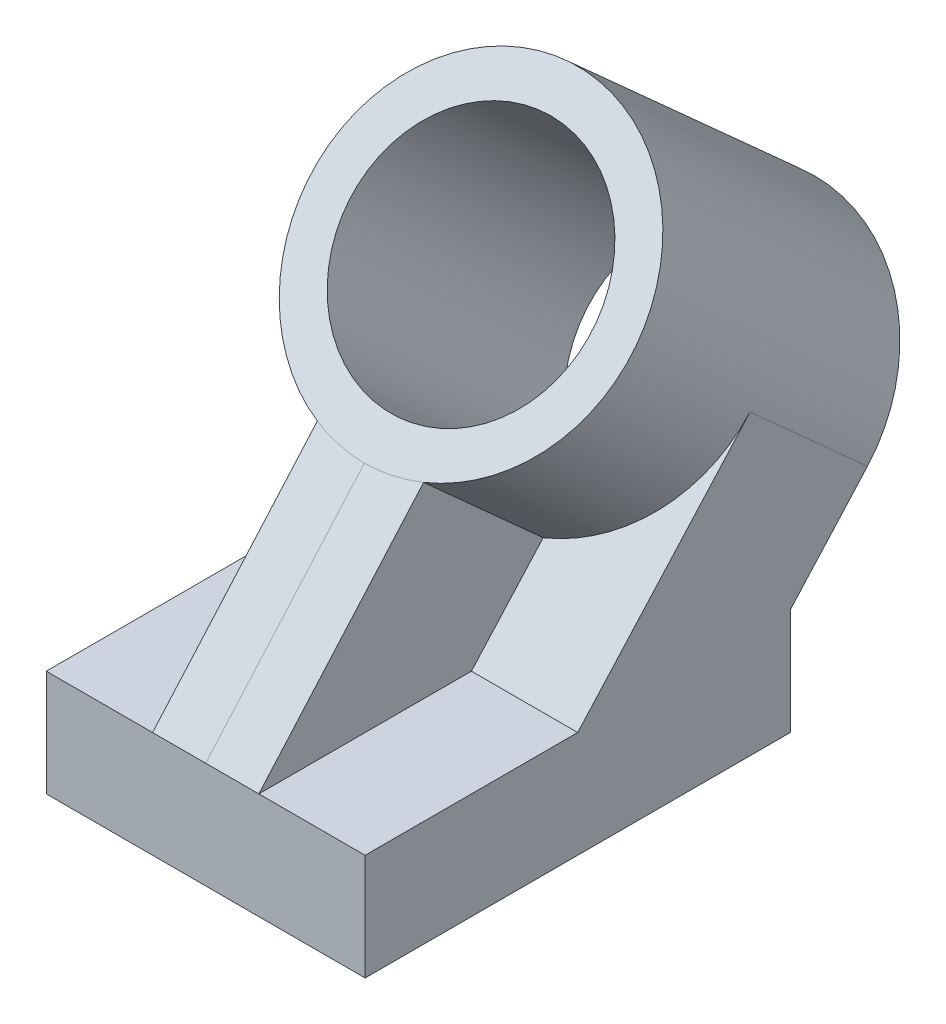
ISO-10303-21;
HEADER;
FILE_DESCRIPTION(('STEP AP214'),'2;1');
FILE_NAME('part.step','',(''),(''),'','','');
FILE_SCHEMA(('AUTOMOTIVE_DESIGN { 1 0 10303 214 1 1 1 1 }'));
ENDSEC;
DATA;
#1=APPLICATION_CONTEXT('core data for automotive mechanical design processes');
#2=APPLICATION_PROTOCOL_DEFINITION('international standard','automotive_design',2000,#1);
#3=PRODUCT_CONTEXT('',#1,'mechanical');
#4=PRODUCT('Part','Part','',(#3));
#5=PRODUCT_RELATED_PRODUCT_CATEGORY('part','',(#4));
#6=PRODUCT_DEFINITION_FORMATION('','',#4);
#7=PRODUCT_DEFINITION_CONTEXT('part definition',#1,'design');
#8=PRODUCT_DEFINITION('design','',#6,#7);
#9=PRODUCT_DEFINITION_SHAPE('','',#8);
#10=(LENGTH_UNIT() NAMED_UNIT(*) SI_UNIT(.MILLI.,.METRE.));
#11=(NAMED_UNIT(*) PLANE_ANGLE_UNIT() SI_UNIT($,.RADIAN.));
#12=(NAMED_UNIT(*) SI_UNIT($,.STERADIAN.) SOLID_ANGLE_UNIT());
#13=UNCERTAINTY_MEASURE_WITH_UNIT(LENGTH_MEASURE(1.E-05),#10,'distance_accuracy_value','');
#14=(GEOMETRIC_REPRESENTATION_CONTEXT(3) GLOBAL_UNCERTAINTY_ASSIGNED_CONTEXT((#13)) GLOBAL_UNIT_ASSIGNED_CONTEXT((#10,
#11,#12)) REPRESENTATION_CONTEXT('',''));
#15=CARTESIAN_POINT('',(0.,0.,0.));
#16=DIRECTION('',(0.,0.,1.));
#17=DIRECTION('',(1.,0.,0.));
#18=AXIS2_PLACEMENT_3D('',#15,#16,#17);
#19=CARTESIAN_POINT('',(-76.2,0.,0.));
#20=DIRECTION('',(0.,1.,0.));
#21=DIRECTION('',(0.,0.,1.));
#22=AXIS2_PLACEMENT_3D('',#19,#20,#21);
#23=PLANE('',#22);
#24=DIRECTION('',(1.,0.,0.));
#25=VECTOR('',#24,1.);
#26=CARTESIAN_POINT('',(-76.2,0.,0.));
#27=LINE('',#26,#25);
#28=CARTESIAN_POINT('',(-76.2,0.,0.));
#29=VERTEX_POINT('',#28);
#30=CARTESIAN_POINT('',(-50.8,0.,0.));
#31=VERTEX_POINT('',#30);
#32=EDGE_CURVE('E14',#29,#31,#27,.T.);
#33=ORIENTED_EDGE('',*,*,#32,.T.);
#34=DIRECTION('',(0.,0.,-1.));
#35=VECTOR('',#34,1.);
#36=CARTESIAN_POINT('',(-50.8,0.,-50.8));
#37=LINE('',#36,#35);
#38=CARTESIAN_POINT('',(-50.8,0.,-50.8));
#39=VERTEX_POINT('',#38);
#40=EDGE_CURVE('E380',#31,#39,#37,.T.);
#41=ORIENTED_EDGE('',*,*,#40,.T.);
#42=DIRECTION('',(1.,0.,0.));
#43=VECTOR('',#42,1.);
#44=CARTESIAN_POINT('',(-76.2,0.,-50.8));
#45=LINE('',#44,#43);
#46=CARTESIAN_POINT('',(-76.2,0.,-50.8));
#47=VERTEX_POINT('',#46);
#48=EDGE_CURVE('E566',#47,#39,#45,.T.);
#49=ORIENTED_EDGE('',*,*,#48,.F.);
#50=DIRECTION('',(0.,0.,1.));
#51=VECTOR('',#50,1.);
#52=CARTESIAN_POINT('',(-76.2,0.,0.));
#53=LINE('',#52,#51);
#54=EDGE_CURVE('E420',#47,#29,#53,.T.);
#55=ORIENTED_EDGE('',*,*,#54,.T.);
#56=EDGE_LOOP('',(#33,#41,#49,#55));
#57=FACE_BOUND('',#56,.T.);
#58=ADVANCED_FACE('F96',(#57),#23,.T.);
#59=CARTESIAN_POINT('',(-76.2,0.,-50.8));
#60=DIRECTION('',(0.,0.669130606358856,0.743144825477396));
#61=DIRECTION('',(0.,-0.743144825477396,0.669130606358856));
#62=AXIS2_PLACEMENT_3D('',#59,#60,#61);
#63=PLANE('',#62);
#64=DIRECTION('',(0.,0.743144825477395,-0.669130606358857));
#65=VECTOR('',#64,1.);
#66=CARTESIAN_POINT('',(-50.8,19.0490347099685,-67.9518278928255));
#67=LINE('',#66,#65);
#68=CARTESIAN_POINT('',(-50.8,19.0490347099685,-67.9518278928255));
#69=VERTEX_POINT('',#68);
#70=EDGE_CURVE('E385',#39,#69,#67,.T.);
#71=ORIENTED_EDGE('',*,*,#70,.T.);
#72=CARTESIAN_POINT('',(-38.1,45.7435581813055,-91.9876847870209));
#73=DIRECTION('',(0.,0.669130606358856,0.743144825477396));
#74=DIRECTION('',(0.,-0.743144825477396,0.669130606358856));
#75=AXIS2_PLACEMENT_3D('',#72,#73,#74);
#76=CIRCLE('',#75,38.1);
#77=CARTESIAN_POINT('',(-76.2,45.7435581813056,-91.9876847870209));
#78=VERTEX_POINT('',#77);
#79=EDGE_CURVE('E552',#78,#69,#76,.T.);
#80=ORIENTED_EDGE('',*,*,#79,.F.);
#81=DIRECTION('',(0.,-0.743144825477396,0.669130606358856));
#82=VECTOR('',#81,1.);
#83=CARTESIAN_POINT('',(-76.2,0.,-50.8));
#84=LINE('',#83,#82);
#85=EDGE_CURVE('E517',#78,#47,#84,.T.);
#86=ORIENTED_EDGE('',*,*,#85,.T.);
#87=ORIENTED_EDGE('',*,*,#48,.T.);
#88=EDGE_LOOP('',(#71,#80,#86,#87));
#89=FACE_BOUND('',#88,.T.);
#90=ADVANCED_FACE('F614',(#89),#63,.T.);
#91=CARTESIAN_POINT('',(-38.1,71.4704542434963,-63.4150720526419));
#92=DIRECTION('',(0.,-0.669130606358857,-0.743144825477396));
#93=DIRECTION('',(0.,0.743144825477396,-0.669130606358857));
#94=AXIS2_PLACEMENT_3D('',#91,#92,#93);
#95=CYLINDRICAL_SURFACE('',#94,38.1);
#96=DIRECTION('',(0.,0.669130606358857,0.743144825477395));
#97=VECTOR('',#96,1.);
#98=CARTESIAN_POINT('',(-50.8,44.7759307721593,-39.3792151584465));
#99=LINE('',#98,#97);
#100=CARTESIAN_POINT('',(-50.8,44.7759307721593,-39.3792151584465));
#101=VERTEX_POINT('',#100);
#102=EDGE_CURVE('E245',#69,#101,#99,.T.);
#103=ORIENTED_EDGE('',*,*,#102,.T.);
#104=CARTESIAN_POINT('',(-38.1,71.4704542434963,-63.4150720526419));
#105=DIRECTION('',(0.,-0.669130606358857,-0.743144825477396));
#106=DIRECTION('',(0.,0.743144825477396,-0.669130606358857));
#107=AXIS2_PLACEMENT_3D('',#104,#105,#106);
#108=CIRCLE('',#107,38.1);
#109=CARTESIAN_POINT('',(-25.4,44.7759307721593,-39.3792151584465));
#110=VERTEX_POINT('',#109);
#111=EDGE_CURVE('E243',#101,#110,#108,.T.);
#112=ORIENTED_EDGE('',*,*,#111,.T.);
#113=DIRECTION('',(0.,0.669130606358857,0.743144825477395));
#114=VECTOR('',#113,1.);
#115=CARTESIAN_POINT('',(-25.4,44.7759307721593,-39.3792151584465));
#116=LINE('',#115,#114);
#117=CARTESIAN_POINT('',(-25.4,19.0490347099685,-67.9518278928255));
#118=VERTEX_POINT('',#117);
#119=EDGE_CURVE('E257',#118,#110,#116,.T.);
#120=ORIENTED_EDGE('',*,*,#119,.F.);
#121=CARTESIAN_POINT('',(0.,45.7435581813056,-91.9876847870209));
#122=VERTEX_POINT('',#121);
#123=EDGE_CURVE('E558',#118,#122,#76,.T.);
#124=ORIENTED_EDGE('',*,*,#123,.T.);
#125=DIRECTION('',(0.,0.669130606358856,0.743144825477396));
#126=VECTOR('',#125,1.);
#127=CARTESIAN_POINT('',(0.,20.4827020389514,-120.042707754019));
#128=LINE('',#127,#126);
#129=CARTESIAN_POINT('',(0.,20.4827020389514,-120.042707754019));
#130=VERTEX_POINT('',#129);
#131=EDGE_CURVE('E492',#130,#122,#128,.T.);
#132=ORIENTED_EDGE('',*,*,#131,.F.);
#133=CARTESIAN_POINT('',(-38.1,20.4827020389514,-120.042707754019));
#134=DIRECTION('',(0.,-0.669130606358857,-0.743144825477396));
#135=DIRECTION('',(0.,0.743144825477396,-0.669130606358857));
#136=AXIS2_PLACEMENT_3D('',#133,#134,#135);
#137=CIRCLE('',#136,38.1);
#138=CARTESIAN_POINT('',(-76.2,20.4827020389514,-120.042707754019));
#139=VERTEX_POINT('',#138);
#140=EDGE_CURVE('E476',#139,#130,#137,.T.);
#141=ORIENTED_EDGE('',*,*,#140,.F.);
#142=DIRECTION('',(0.,0.669130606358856,0.743144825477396));
#143=VECTOR('',#142,1.);
#144=CARTESIAN_POINT('',(-76.2,20.4827020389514,-120.042707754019));
#145=LINE('',#144,#143);
#146=EDGE_CURVE('E528',#139,#78,#145,.T.);
#147=ORIENTED_EDGE('',*,*,#146,.T.);
#148=ORIENTED_EDGE('',*,*,#79,.T.);
#149=EDGE_LOOP('',(#103,#112,#120,#124,#132,#141,#147,#148));
#150=FACE_BOUND('',#149,.T.);
#151=ADVANCED_FACE('F343',(#150),#95,.T.);
#152=CARTESIAN_POINT('',(-76.2,0.,-101.6));
#153=DIRECTION('',(0.,-0.669130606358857,-0.743144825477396));
#154=DIRECTION('',(0.,0.743144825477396,-0.669130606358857));
#155=AXIS2_PLACEMENT_3D('',#152,#153,#154);
#156=PLANE('',#155);
#157=CARTESIAN_POINT('',(-38.1,20.4827020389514,-120.042707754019));
#158=DIRECTION('',(0.,-0.669130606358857,-0.743144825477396));
#159=DIRECTION('',(0.,0.743144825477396,-0.669130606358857));
#160=AXIS2_PLACEMENT_3D('',#157,#158,#159);
#161=CIRCLE('',#160,28.575);
#162=CARTESIAN_POINT('',(-30.5597033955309,0.,-101.6));
#163=VERTEX_POINT('',#162);
#164=CARTESIAN_POINT('',(-45.6402966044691,0.,-101.6));
#165=VERTEX_POINT('',#164);
#166=EDGE_CURVE('E471',#163,#165,#161,.T.);
#167=ORIENTED_EDGE('',*,*,#166,.F.);
#168=DIRECTION('',(-1.,0.,0.));
#169=VECTOR('',#168,1.);
#170=CARTESIAN_POINT('',(-76.2,0.,-101.6));
#171=LINE('',#170,#169);
#172=EDGE_CURVE('E512',#163,#165,#171,.T.);
#173=ORIENTED_EDGE('',*,*,#172,.T.);
#174=EDGE_LOOP('',(#167,#173));
#175=FACE_BOUND('',#174,.T.);
#176=ADVANCED_FACE('F608',(#175),#156,.F.);
#177=CARTESIAN_POINT('',(-76.2,0.,0.));
#178=DIRECTION('',(0.,0.,1.));
#179=DIRECTION('',(0.,-1.,0.));
#180=AXIS2_PLACEMENT_3D('',#177,#178,#179);
#181=PLANE('',#180);
#182=DIRECTION('',(0.,-1.,0.));
#183=VECTOR('',#182,1.);
#184=CARTESIAN_POINT('',(0.,0.,0.));
#185=LINE('',#184,#183);
#186=CARTESIAN_POINT('',(0.,0.,0.));
#187=VERTEX_POINT('',#186);
#188=CARTESIAN_POINT('',(0.,-25.4,0.));
#189=VERTEX_POINT('',#188);
#190=EDGE_CURVE('E507',#187,#189,#185,.T.);
#191=ORIENTED_EDGE('',*,*,#190,.F.);
#192=CARTESIAN_POINT('',(-25.4,0.,0.));
#193=VERTEX_POINT('',#192);
#194=EDGE_CURVE('E107',#193,#187,#27,.T.);
#195=ORIENTED_EDGE('',*,*,#194,.F.);
#196=DIRECTION('',(1.,0.,0.));
#197=VECTOR('',#196,1.);
#198=CARTESIAN_POINT('',(-31.75,0.,0.));
#199=LINE('',#198,#197);
#200=CARTESIAN_POINT('',(-38.1,0.,0.));
#201=VERTEX_POINT('',#200);
#202=EDGE_CURVE('E232',#201,#193,#199,.T.);
#203=ORIENTED_EDGE('',*,*,#202,.F.);
#204=DIRECTION('',(-1.,0.,0.));
#205=VECTOR('',#204,1.);
#206=CARTESIAN_POINT('',(-44.45,0.,0.));
#207=LINE('',#206,#205);
#208=EDGE_CURVE('E128',#201,#31,#207,.T.);
#209=ORIENTED_EDGE('',*,*,#208,.T.);
#210=ORIENTED_EDGE('',*,*,#32,.F.);
#211=DIRECTION('',(0.,-1.,0.));
#212=VECTOR('',#211,1.);
#213=CARTESIAN_POINT('',(-76.2,0.,0.));
#214=LINE('',#213,#212);
#215=CARTESIAN_POINT('',(-76.2,-25.4,0.));
#216=VERTEX_POINT('',#215);
#217=EDGE_CURVE('E546',#29,#216,#214,.T.);
#218=ORIENTED_EDGE('',*,*,#217,.T.);
#219=DIRECTION('',(1.,0.,0.));
#220=VECTOR('',#219,1.);
#221=CARTESIAN_POINT('',(-76.2,-25.4,0.));
#222=LINE('',#221,#220);
#223=EDGE_CURVE('E415',#216,#189,#222,.T.);
#224=ORIENTED_EDGE('',*,*,#223,.T.);
#225=EDGE_LOOP('',(#191,#195,#203,#209,#210,#218,#224));
#226=FACE_BOUND('',#225,.T.);
#227=ADVANCED_FACE('F99',(#226),#181,.T.);
#228=DIRECTION('',(0.,0.,-1.));
#229=VECTOR('',#228,1.);
#230=CARTESIAN_POINT('',(-25.4,0.,-50.8));
#231=LINE('',#230,#229);
#232=CARTESIAN_POINT('',(-25.4,0.,-50.8));
#233=VERTEX_POINT('',#232);
#234=EDGE_CURVE('E118',#193,#233,#231,.T.);
#235=ORIENTED_EDGE('',*,*,#234,.F.);
#236=ORIENTED_EDGE('',*,*,#194,.T.);
#237=DIRECTION('',(0.,0.,1.));
#238=VECTOR('',#237,1.);
#239=CARTESIAN_POINT('',(0.,0.,0.));
#240=LINE('',#239,#238);
#241=CARTESIAN_POINT('',(0.,0.,-50.8));
#242=VERTEX_POINT('',#241);
#243=EDGE_CURVE('E428',#242,#187,#240,.T.);
#244=ORIENTED_EDGE('',*,*,#243,.F.);
#245=EDGE_CURVE('E567',#233,#242,#45,.T.);
#246=ORIENTED_EDGE('',*,*,#245,.F.);
#247=EDGE_LOOP('',(#235,#236,#244,#246));
#248=FACE_BOUND('',#247,.T.);
#249=ADVANCED_FACE('F594',(#248),#23,.T.);
#250=DIRECTION('',(0.,0.743144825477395,-0.669130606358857));
#251=VECTOR('',#250,1.);
#252=CARTESIAN_POINT('',(-25.4,19.0490347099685,-67.9518278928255));
#253=LINE('',#252,#251);
#254=EDGE_CURVE('E450',#233,#118,#253,.T.);
#255=ORIENTED_EDGE('',*,*,#254,.F.);
#256=ORIENTED_EDGE('',*,*,#245,.T.);
#257=DIRECTION('',(0.,-0.743144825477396,0.669130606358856));
#258=VECTOR('',#257,1.);
#259=CARTESIAN_POINT('',(0.,0.,-50.8));
#260=LINE('',#259,#258);
#261=EDGE_CURVE('E499',#122,#242,#260,.T.);
#262=ORIENTED_EDGE('',*,*,#261,.F.);
#263=ORIENTED_EDGE('',*,*,#123,.F.);
#264=EDGE_LOOP('',(#255,#256,#262,#263));
#265=FACE_BOUND('',#264,.T.);
#266=ADVANCED_FACE('F623',(#265),#63,.T.);
#267=CARTESIAN_POINT('',(-76.2,0.,-101.6));
#268=DIRECTION('',(0.,-0.669130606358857,-0.743144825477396));
#269=DIRECTION('',(0.,0.743144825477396,-0.669130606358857));
#270=AXIS2_PLACEMENT_3D('',#267,#268,#269);
#271=PLANE('',#270);
#272=DIRECTION('',(0.,0.743144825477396,-0.669130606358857));
#273=VECTOR('',#272,1.);
#274=CARTESIAN_POINT('',(-76.2,0.,-101.6));
#275=LINE('',#274,#273);
#276=CARTESIAN_POINT('',(-76.2,0.,-101.6));
#277=VERTEX_POINT('',#276);
#278=EDGE_CURVE('E531',#277,#139,#275,.T.);
#279=ORIENTED_EDGE('',*,*,#278,.T.);
#280=ORIENTED_EDGE('',*,*,#140,.T.);
#281=DIRECTION('',(0.,0.743144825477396,-0.669130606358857));
#282=VECTOR('',#281,1.);
#283=CARTESIAN_POINT('',(0.,0.,-101.6));
#284=LINE('',#283,#282);
#285=CARTESIAN_POINT('',(0.,0.,-101.6));
#286=VERTEX_POINT('',#285);
#287=EDGE_CURVE('E486',#286,#130,#284,.T.);
#288=ORIENTED_EDGE('',*,*,#287,.F.);
#289=DIRECTION('',(1.,0.,0.));
#290=VECTOR('',#289,1.);
#291=CARTESIAN_POINT('',(-76.2,0.,-101.6));
#292=LINE('',#291,#290);
#293=EDGE_CURVE('E414',#163,#286,#292,.T.);
#294=ORIENTED_EDGE('',*,*,#293,.F.);
#295=EDGE_CURVE('E256',#165,#163,#161,.T.);
#296=ORIENTED_EDGE('',*,*,#295,.F.);
#297=EDGE_CURVE('E416',#277,#165,#292,.T.);
#298=ORIENTED_EDGE('',*,*,#297,.F.);
#299=EDGE_LOOP('',(#279,#280,#288,#294,#296,#298));
#300=FACE_BOUND('',#299,.T.);
#301=ADVANCED_FACE('F583',(#300),#271,.T.);
#302=CARTESIAN_POINT('',(-76.2,-25.4,-101.6));
#303=DIRECTION('',(0.,0.,-1.));
#304=DIRECTION('',(-1.,0.,0.));
#305=AXIS2_PLACEMENT_3D('',#302,#303,#304);
#306=PLANE('',#305);
#307=DIRECTION('',(0.,1.,0.));
#308=VECTOR('',#307,1.);
#309=CARTESIAN_POINT('',(0.,-25.4,-101.6));
#310=LINE('',#309,#308);
#311=CARTESIAN_POINT('',(0.,-25.4,-101.6));
#312=VERTEX_POINT('',#311);
#313=EDGE_CURVE('E493',#312,#286,#310,.T.);
#314=ORIENTED_EDGE('',*,*,#313,.F.);
#315=DIRECTION('',(1.,0.,0.));
#316=VECTOR('',#315,1.);
#317=CARTESIAN_POINT('',(-76.2,-25.4,-101.6));
#318=LINE('',#317,#316);
#319=CARTESIAN_POINT('',(-76.2,-25.4,-101.6));
#320=VERTEX_POINT('',#319);
#321=EDGE_CURVE('E409',#320,#312,#318,.T.);
#322=ORIENTED_EDGE('',*,*,#321,.F.);
#323=DIRECTION('',(0.,1.,0.));
#324=VECTOR('',#323,1.);
#325=CARTESIAN_POINT('',(-76.2,-25.4,-101.6));
#326=LINE('',#325,#324);
#327=EDGE_CURVE('E536',#320,#277,#326,.T.);
#328=ORIENTED_EDGE('',*,*,#327,.T.);
#329=ORIENTED_EDGE('',*,*,#297,.T.);
#330=ORIENTED_EDGE('',*,*,#172,.F.);
#331=ORIENTED_EDGE('',*,*,#293,.T.);
#332=EDGE_LOOP('',(#314,#322,#328,#329,#330,#331));
#333=FACE_BOUND('',#332,.T.);
#334=ADVANCED_FACE('F579',(#333),#306,.T.);
#335=CARTESIAN_POINT('',(-76.2,-25.4,0.));
#336=DIRECTION('',(0.,-1.,0.));
#337=DIRECTION('',(0.,0.,-1.));
#338=AXIS2_PLACEMENT_3D('',#335,#336,#337);
#339=PLANE('',#338);
#340=DIRECTION('',(0.,0.,-1.));
#341=VECTOR('',#340,1.);
#342=CARTESIAN_POINT('',(0.,-25.4,0.));
#343=LINE('',#342,#341);
#344=EDGE_CURVE('E503',#189,#312,#343,.T.);
#345=ORIENTED_EDGE('',*,*,#344,.F.);
#346=ORIENTED_EDGE('',*,*,#223,.F.);
#347=DIRECTION('',(0.,0.,-1.));
#348=VECTOR('',#347,1.);
#349=CARTESIAN_POINT('',(-76.2,-25.4,0.));
#350=LINE('',#349,#348);
#351=EDGE_CURVE('E541',#216,#320,#350,.T.);
#352=ORIENTED_EDGE('',*,*,#351,.T.);
#353=ORIENTED_EDGE('',*,*,#321,.T.);
#354=EDGE_LOOP('',(#345,#346,#352,#353));
#355=FACE_BOUND('',#354,.T.);
#356=ADVANCED_FACE('F599',(#355),#339,.T.);
#357=CARTESIAN_POINT('',(-76.2,0.,0.));
#358=DIRECTION('',(1.,0.,0.));
#359=DIRECTION('',(0.,0.,-1.));
#360=AXIS2_PLACEMENT_3D('',#357,#358,#359);
#361=PLANE('',#360);
#362=ORIENTED_EDGE('',*,*,#217,.F.);
#363=ORIENTED_EDGE('',*,*,#54,.F.);
#364=ORIENTED_EDGE('',*,*,#85,.F.);
#365=ORIENTED_EDGE('',*,*,#146,.F.);
#366=ORIENTED_EDGE('',*,*,#278,.F.);
#367=ORIENTED_EDGE('',*,*,#327,.F.);
#368=ORIENTED_EDGE('',*,*,#351,.F.);
#369=EDGE_LOOP('',(#362,#363,#364,#365,#366,#367,#368));
#370=FACE_BOUND('',#369,.T.);
#371=ADVANCED_FACE('F603',(#370),#361,.F.);
#372=CARTESIAN_POINT('',(0.,0.,0.));
#373=DIRECTION('',(1.,0.,0.));
#374=DIRECTION('',(0.,0.,-1.));
#375=AXIS2_PLACEMENT_3D('',#372,#373,#374);
#376=PLANE('',#375);
#377=ORIENTED_EDGE('',*,*,#190,.T.);
#378=ORIENTED_EDGE('',*,*,#344,.T.);
#379=ORIENTED_EDGE('',*,*,#313,.T.);
#380=ORIENTED_EDGE('',*,*,#287,.T.);
#381=ORIENTED_EDGE('',*,*,#131,.T.);
#382=ORIENTED_EDGE('',*,*,#261,.T.);
#383=ORIENTED_EDGE('',*,*,#243,.T.);
#384=EDGE_LOOP('',(#377,#378,#379,#380,#381,#382,#383));
#385=FACE_BOUND('',#384,.T.);
#386=ADVANCED_FACE('F586',(#385),#376,.T.);
#387=CARTESIAN_POINT('',(-38.1,71.4704542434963,-63.4150720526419));
#388=DIRECTION('',(0.,-0.669130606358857,-0.743144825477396));
#389=DIRECTION('',(0.,0.743144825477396,-0.669130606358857));
#390=AXIS2_PLACEMENT_3D('',#387,#388,#389);
#391=PLANE('',#390);
#392=CARTESIAN_POINT('',(-38.1,71.4704542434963,-63.4150720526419));
#393=DIRECTION('',(0.,-0.669130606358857,-0.743144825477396));
#394=DIRECTION('',(0.,0.743144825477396,-0.669130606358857));
#395=AXIS2_PLACEMENT_3D('',#392,#393,#394);
#396=CIRCLE('',#395,28.575);
#397=CARTESIAN_POINT('',(-38.1,92.7058176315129,-82.5354791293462));
#398=VERTEX_POINT('',#397);
#399=EDGE_CURVE('E271',#398,#398,#396,.T.);
#400=ORIENTED_EDGE('',*,*,#399,.T.);
#401=EDGE_LOOP('',(#400));
#402=FACE_BOUND('',#401,.T.);
#403=ORIENTED_EDGE('',*,*,#111,.F.);
#404=CARTESIAN_POINT('',(-38.1,43.1566363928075,-37.9211959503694));
#405=CARTESIAN_POINT('',(-38.6496266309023,43.1566303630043,-37.9211906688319));
#406=CARTESIAN_POINT('',(-39.1992528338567,43.1654683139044,-37.929160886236));
#407=CARTESIAN_POINT('',(-40.2974117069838,43.2007925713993,-37.9610062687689));
#408=CARTESIAN_POINT('',(-40.8459444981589,43.2272768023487,-37.9848795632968));
#409=CARTESIAN_POINT('',(-41.9409557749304,43.2978541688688,-38.0484851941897));
#410=CARTESIAN_POINT('',(-42.4874342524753,43.3419473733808,-38.0882175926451));
#411=CARTESIAN_POINT('',(-43.57737336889,43.4476688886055,-38.1834657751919));
#412=CARTESIAN_POINT('',(-44.1208336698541,43.5092991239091,-38.2389832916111));
#413=CARTESIAN_POINT('',(-45.1834667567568,43.6473584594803,-38.3633290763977));
#414=CARTESIAN_POINT('',(-45.702789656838,43.7231501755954,-38.4315839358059));
#415=CARTESIAN_POINT('',(-46.7367946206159,43.8907609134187,-38.5825059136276));
#416=CARTESIAN_POINT('',(-47.2514761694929,43.982581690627,-38.6651746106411));
#417=CARTESIAN_POINT('',(-48.2756861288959,44.182175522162,-38.8448513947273));
#418=CARTESIAN_POINT('',(-48.7852097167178,44.2899622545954,-38.9418717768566));
#419=CARTESIAN_POINT('',(-49.7977166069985,44.5212260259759,-39.1500122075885));
#420=CARTESIAN_POINT('',(-50.3007005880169,44.6447014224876,-39.2611307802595));
#421=CARTESIAN_POINT('',(-50.8,44.7759307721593,-39.3792151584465));
#422=B_SPLINE_CURVE_WITH_KNOTS('',3,(#404,#405,#406,#407,#408,#409,#410,#411,#412,#413,#414,
#415,#416,#417,#418,#419,#420,#421),.UNSPECIFIED.,.F.,.F.,(4,2,2,2,2,2,2,2,4),(0.,
1.64875054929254,3.29730719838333,4.94587030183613,6.59461439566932,8.18189085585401,
9.7693412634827,11.3581595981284,12.9468117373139),.UNSPECIFIED.);
#423=CARTESIAN_POINT('',(-38.1,43.1566363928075,-37.9211959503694));
#424=VERTEX_POINT('',#423);
#425=EDGE_CURVE('E224',#424,#101,#422,.T.);
#426=ORIENTED_EDGE('',*,*,#425,.F.);
#427=CARTESIAN_POINT('',(-25.4,44.7759307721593,-39.3792151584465));
#428=CARTESIAN_POINT('',(-25.918190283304,44.639735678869,-39.2566624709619));
#429=CARTESIAN_POINT('',(-26.4403498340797,44.5118931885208,-39.1416133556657));
#430=CARTESIAN_POINT('',(-27.4915572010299,44.2731397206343,-38.9267303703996));
#431=CARTESIAN_POINT('',(-28.0206041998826,44.1622267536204,-38.82689471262));
#432=CARTESIAN_POINT('',(-29.0846606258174,43.9575261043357,-38.6426174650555));
#433=CARTESIAN_POINT('',(-29.6196700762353,43.8637384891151,-38.5581759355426));
#434=CARTESIAN_POINT('',(-30.6947078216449,43.6934503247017,-38.4048386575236));
#435=CARTESIAN_POINT('',(-31.2347366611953,43.6169516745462,-38.3359446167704));
#436=CARTESIAN_POINT('',(-32.2985306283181,43.4839223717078,-38.216124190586));
#437=CARTESIAN_POINT('',(-32.8221515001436,43.4267536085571,-38.1646237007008));
#438=CARTESIAN_POINT('',(-33.8722025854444,43.3286695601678,-38.0762534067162));
#439=CARTESIAN_POINT('',(-34.3986331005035,43.2877560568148,-38.0393852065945));
#440=CARTESIAN_POINT('',(-35.4537856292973,43.2222320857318,-37.9803323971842));
#441=CARTESIAN_POINT('',(-35.9825092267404,43.1976356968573,-37.9581604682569));
#442=CARTESIAN_POINT('',(-37.0408217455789,43.1648361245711,-37.9285907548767));
#443=CARTESIAN_POINT('',(-37.5704105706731,43.1566312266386,-37.9211914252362));
#444=CARTESIAN_POINT('',(-38.1,43.1566363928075,-37.9211959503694));
#445=B_SPLINE_CURVE_WITH_KNOTS('',3,(#427,#428,#429,#430,#431,#432,#433,#434,#435,#436,#437,
#438,#439,#440,#441,#442,#443,#444),.UNSPECIFIED.,.F.,.F.,(4,2,2,2,2,2,2,2,4),(0.,
1.64875055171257,3.2973072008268,4.9458703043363,6.59461439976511,8.18189086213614,
9.76934127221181,11.3581596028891,12.9468117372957),.UNSPECIFIED.);
#446=EDGE_CURVE('E240',#110,#424,#445,.T.);
#447=ORIENTED_EDGE('',*,*,#446,.F.);
#448=EDGE_LOOP('',(#403,#426,#447));
#449=FACE_BOUND('',#448,.T.);
#450=ADVANCED_FACE('F239',(#402,#449),#391,.F.);
#451=CARTESIAN_POINT('',(-38.1,71.4704542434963,-63.4150720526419));
#452=DIRECTION('',(0.,-0.669130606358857,-0.743144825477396));
#453=DIRECTION('',(0.,0.743144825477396,-0.669130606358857));
#454=AXIS2_PLACEMENT_3D('',#451,#452,#453);
#455=CYLINDRICAL_SURFACE('',#454,28.575);
#456=ORIENTED_EDGE('',*,*,#399,.F.);
#457=EDGE_LOOP('',(#456));
#458=FACE_BOUND('',#457,.T.);
#459=ORIENTED_EDGE('',*,*,#166,.T.);
#460=ORIENTED_EDGE('',*,*,#295,.T.);
#461=EDGE_LOOP('',(#459,#460));
#462=FACE_BOUND('',#461,.T.);
#463=ADVANCED_FACE('F607',(#458,#462),#455,.F.);
#464=CARTESIAN_POINT('',(-25.4,0.,0.));
#465=DIRECTION('',(1.,0.,0.));
#466=DIRECTION('',(0.,0.,-1.));
#467=AXIS2_PLACEMENT_3D('',#464,#465,#466);
#468=PLANE('',#467);
#469=ORIENTED_EDGE('',*,*,#254,.T.);
#470=ORIENTED_EDGE('',*,*,#119,.T.);
#471=DIRECTION('',(0.,-0.750909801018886,0.660404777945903));
#472=VECTOR('',#471,1.);
#473=CARTESIAN_POINT('',(-25.4,0.,0.));
#474=LINE('',#473,#472);
#475=EDGE_CURVE('E253',#110,#193,#474,.T.);
#476=ORIENTED_EDGE('',*,*,#475,.T.);
#477=ORIENTED_EDGE('',*,*,#234,.T.);
#478=EDGE_LOOP('',(#469,#470,#476,#477));
#479=FACE_BOUND('',#478,.T.);
#480=ADVANCED_FACE('F289',(#479),#468,.T.);
#481=CARTESIAN_POINT('',(-38.1,43.1566363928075,-37.9211959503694));
#482=CARTESIAN_POINT('',(-33.7790867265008,43.1566363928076,-37.9211959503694));
#483=CARTESIAN_POINT('',(-29.4581734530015,43.7384388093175,-38.4450531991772));
#484=CARTESIAN_POINT('',(-25.4,44.7759307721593,-39.3792151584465));
#485=CARTESIAN_POINT('',(-38.1,28.7710909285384,-25.2807973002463));
#486=CARTESIAN_POINT('',(-33.8082800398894,28.7710909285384,-25.2807973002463));
#487=CARTESIAN_POINT('',(-29.5165600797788,29.1589592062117,-25.6300354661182));
#488=CARTESIAN_POINT('',(-25.4,29.8506205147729,-26.252810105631));
#489=CARTESIAN_POINT('',(-38.1,14.3855454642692,-12.6403986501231));
#490=CARTESIAN_POINT('',(-33.837473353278,14.3855454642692,-12.6403986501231));
#491=CARTESIAN_POINT('',(-29.5749467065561,14.5794796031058,-12.8150177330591));
#492=CARTESIAN_POINT('',(-25.4,14.9253102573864,-13.1264050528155));
#493=CARTESIAN_POINT('',(-38.1,0.,0.));
#494=CARTESIAN_POINT('',(-33.8666666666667,0.,0.));
#495=CARTESIAN_POINT('',(-29.6333333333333,0.,0.));
#496=CARTESIAN_POINT('',(-25.4,0.,0.));
#497=B_SPLINE_SURFACE_WITH_KNOTS('',3,3,((#481,#482,#483,#484),(#485,#486,#487,#488),(#489,#490,
#491,#492),(#493,#494,#495,#496)),.UNSPECIFIED.,.F.,.F.,.F.,(4,4),(4,4),(0.,1.),(0.,1.),.UNSPECIFIED.);
#498=DIRECTION('',(0.,-0.751202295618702,0.660072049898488));
#499=VECTOR('',#498,1.);
#500=CARTESIAN_POINT('',(-38.1,0.,0.));
#501=LINE('',#500,#499);
#502=EDGE_CURVE('E220',#424,#201,#501,.T.);
#503=ORIENTED_EDGE('',*,*,#475,.F.);
#504=ORIENTED_EDGE('',*,*,#446,.T.);
#505=ORIENTED_EDGE('',*,*,#502,.T.);
#506=ORIENTED_EDGE('',*,*,#202,.T.);
#507=EDGE_LOOP('',(#503,#504,#505,#506));
#508=FACE_BOUND('',#507,.T.);
#509=ADVANCED_FACE('F251',(#508),#497,.T.);
#510=CARTESIAN_POINT('',(-50.8,0.,0.));
#511=DIRECTION('',(-1.,0.,0.));
#512=DIRECTION('',(0.,0.,-1.));
#513=AXIS2_PLACEMENT_3D('',#510,#511,#512);
#514=PLANE('',#513);
#515=ORIENTED_EDGE('',*,*,#70,.F.);
#516=ORIENTED_EDGE('',*,*,#40,.F.);
#517=DIRECTION('',(0.,-0.750909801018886,0.660404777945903));
#518=VECTOR('',#517,1.);
#519=CARTESIAN_POINT('',(-50.8,0.,0.));
#520=LINE('',#519,#518);
#521=EDGE_CURVE('E377',#101,#31,#520,.T.);
#522=ORIENTED_EDGE('',*,*,#521,.F.);
#523=ORIENTED_EDGE('',*,*,#102,.F.);
#524=EDGE_LOOP('',(#515,#516,#522,#523));
#525=FACE_BOUND('',#524,.T.);
#526=ADVANCED_FACE('F288',(#525),#514,.T.);
#527=CARTESIAN_POINT('',(-38.1,43.1566363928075,-37.9211959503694));
#528=CARTESIAN_POINT('',(-42.4209132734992,43.1566363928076,-37.9211959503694));
#529=CARTESIAN_POINT('',(-46.7418265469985,43.7384388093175,-38.4450531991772));
#530=CARTESIAN_POINT('',(-50.8,44.7759307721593,-39.3792151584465));
#531=CARTESIAN_POINT('',(-38.1,28.7710909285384,-25.2807973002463));
#532=CARTESIAN_POINT('',(-42.3917199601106,28.7710909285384,-25.2807973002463));
#533=CARTESIAN_POINT('',(-46.6834399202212,29.1589592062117,-25.6300354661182));
#534=CARTESIAN_POINT('',(-50.8,29.8506205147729,-26.252810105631));
#535=CARTESIAN_POINT('',(-38.1,14.3855454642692,-12.6403986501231));
#536=CARTESIAN_POINT('',(-42.362526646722,14.3855454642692,-12.6403986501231));
#537=CARTESIAN_POINT('',(-46.6250532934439,14.5794796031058,-12.8150177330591));
#538=CARTESIAN_POINT('',(-50.8,14.9253102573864,-13.1264050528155));
#539=CARTESIAN_POINT('',(-38.1,0.,0.));
#540=CARTESIAN_POINT('',(-42.3333333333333,0.,0.));
#541=CARTESIAN_POINT('',(-46.5666666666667,0.,0.));
#542=CARTESIAN_POINT('',(-50.8,0.,0.));
#543=B_SPLINE_SURFACE_WITH_KNOTS('',3,3,((#527,#528,#529,#530),(#531,#532,#533,#534),(#535,#536,
#537,#538),(#539,#540,#541,#542)),.UNSPECIFIED.,.F.,.F.,.F.,(4,4),(4,4),(0.,1.),(0.,1.),.UNSPECIFIED.);
#544=ORIENTED_EDGE('',*,*,#502,.F.);
#545=ORIENTED_EDGE('',*,*,#425,.T.);
#546=ORIENTED_EDGE('',*,*,#521,.T.);
#547=ORIENTED_EDGE('',*,*,#208,.F.);
#548=EDGE_LOOP('',(#544,#545,#546,#547));
#549=FACE_BOUND('',#548,.T.);
#550=ADVANCED_FACE('F223',(#549),#543,.F.);
#551=CLOSED_SHELL('',(#58,#90,#151,#176,#227,#249,#266,#301,#334,#356,#371,#386,#450,#463,#480,
#509,#526,#550));
#552=MANIFOLD_SOLID_BREP('B2',#551);
#553=ADVANCED_BREP_SHAPE_REPRESENTATION('',(#18,#552),#14);
#554=SHAPE_DEFINITION_REPRESENTATION(#9,#553);
ENDSEC;
END-ISO-10303-21;
